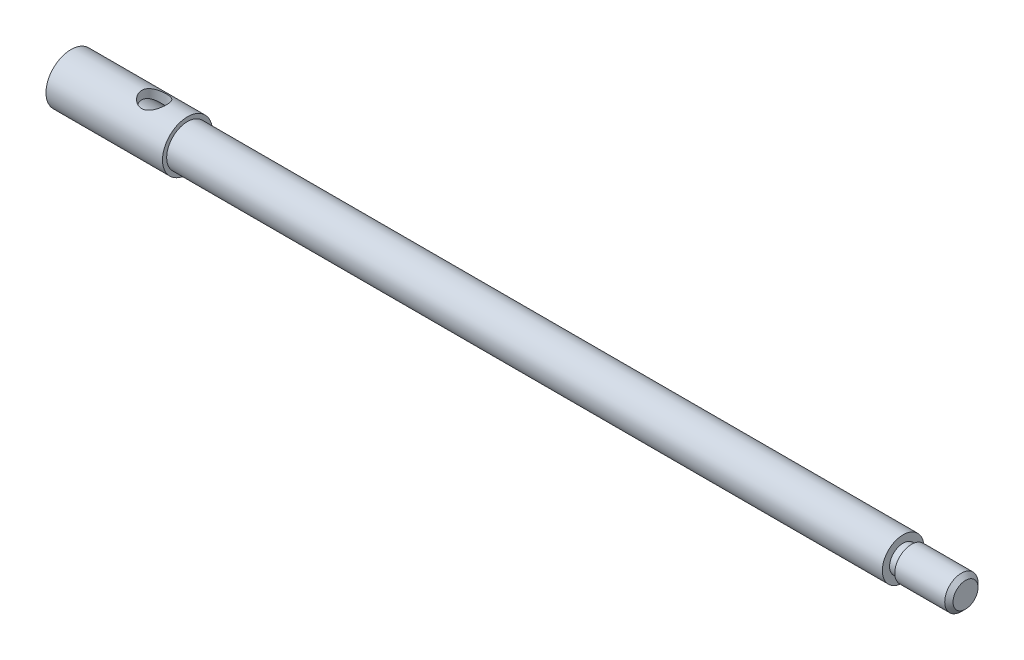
from build123d import *

# Parameters (mm, degrees)
HOLE_WIZARD_1_D          = 8
HOLE_WIZARD_1_DEPTH      = 25
HOLE_WIZARD_1_TIP        = 2.403442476
CUT_EXTRUDE_1_DEPTH      = 112.363385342
CUT_EXTRUDE_1_DEPTH_BACK = 112.363385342
SKETCH_5_R               = 3
CHAMFER_1_SIZE           = 1


with BuildPart() as part:
    # Sketch 1 → Revolve 1 (revolve)
    with BuildSketch(Plane.XY, mode=Mode.PRIVATE) as revolve_1_sk:
        Polygon((-111.039648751, 0), (-111.039648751, 6), (-83.039648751, 6), (-83.039648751, 5), (88.960351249, 5), (88.960351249, 3.25), (90.960351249, 3.25), (90.960351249, 4), (103.960351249, 4), (103.960351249, 0), align=None)
    revolve(revolve_1_sk.sketch.rotate(Axis((-111.039648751, 0, 0), (1, 0, 0)), 90), axis=Axis((-111.039648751, 0, 0), (1, 0, 0)))

    # Hole Wizard 1
    with Locations(Plane.ZY.offset(111.039648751)):
        with Locations((0, 0)):
            Hole(HOLE_WIZARD_1_D / 2, depth=HOLE_WIZARD_1_DEPTH)
            with Locations((0, 0, -(HOLE_WIZARD_1_DEPTH + HOLE_WIZARD_1_TIP / 2))):  # 118° drill point
                Cone(0, HOLE_WIZARD_1_D / 2, HOLE_WIZARD_1_TIP, mode=Mode.SUBTRACT)

    # Sketch 5 → Cut-Extrude 1 (cut, two sides: drawn at the far end of the back side and taken through both)
    with BuildSketch(Plane(origin=(0, 0, 0), x_dir=(1, 0, 0), z_dir=(0, 1, 0)).offset(-CUT_EXTRUDE_1_DEPTH_BACK)):
        with Locations(Location((-91.039648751, 0, 0), (0, 0, 270))):
            Circle(SKETCH_5_R)
    extrude(amount=CUT_EXTRUDE_1_DEPTH + CUT_EXTRUDE_1_DEPTH_BACK, mode=Mode.SUBTRACT)

    # Chamfer 1
    chamfer_1_edges = [part.edges().sort_by_distance(p)[0] for p in [
        (103.960351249, 0, -4),
    ]]
    chamfer(chamfer_1_edges, length=CHAMFER_1_SIZE)


solid = part.part
